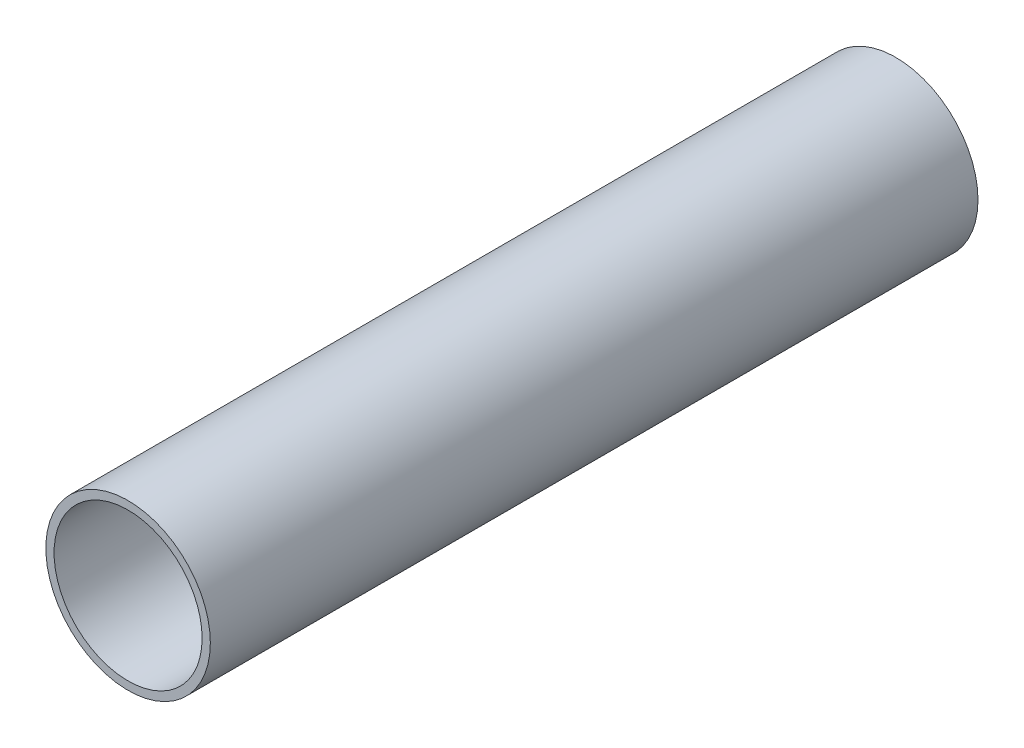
from build123d import *

# Parameters (mm, degrees)
ESQUISSE1_R      = 15
ESQUISSE1_R_2    = 13.5
EXTRUSION1_DEPTH = 140


with BuildPart() as part:
    # Esquisse1 → Extrusion1 (new body)
    with BuildSketch(Plane.XY):
        Circle(ESQUISSE1_R)
        Circle(ESQUISSE1_R_2, mode=Mode.SUBTRACT)
    extrude(amount=EXTRUSION1_DEPTH)


solid = part.part
